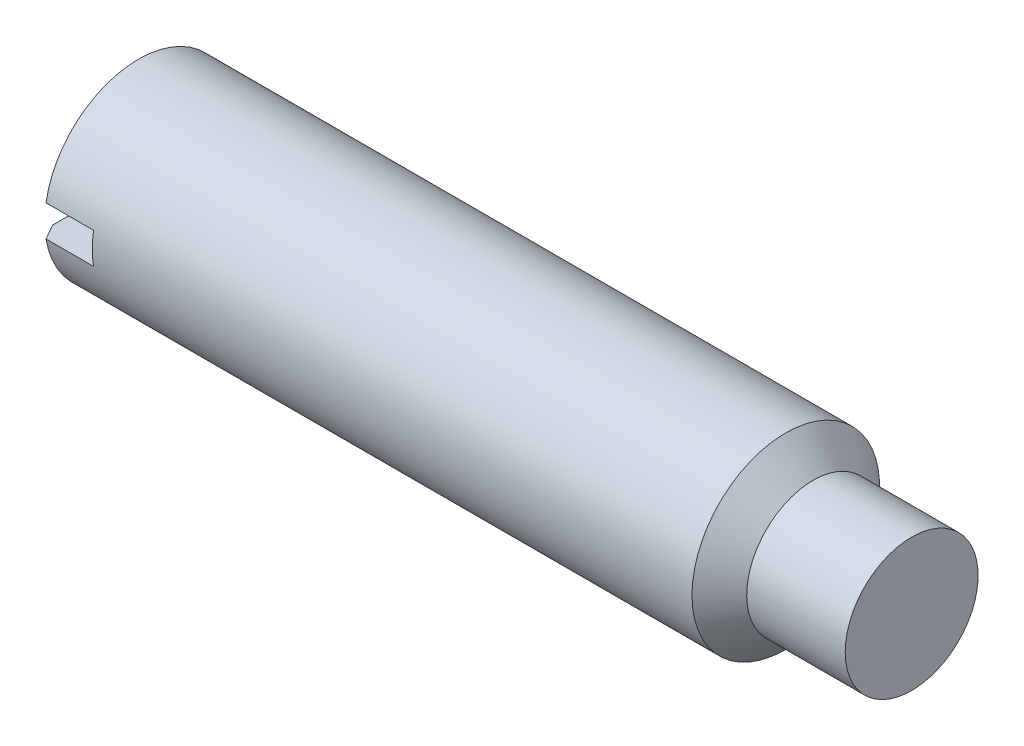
from build123d import *

# Parameters (mm, degrees)
SKETCH2_W  = 12
SKETCH2_H  = 2
SLOT_DEPTH = 3.6


with BuildPart() as part:
    # BodySke → BaseBody (revolve)
    with BuildSketch(Plane.XY, mode=Mode.PRIVATE) as basebody_sk:
        Polygon((43.7, 4.25), (50, 4.25), (50, 0), (0, 0), (0, 5.036), (0.556565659, 6), (41.95, 6), align=None)
    revolve(basebody_sk.sketch.rotate(Axis((-12.7, 0, 0), (1, 0, 0)), 90), axis=Axis((-12.7, 0, 0), (1, 0, 0)))

    # Sketch2 → Slot (cut)
    with BuildSketch(Plane(origin=(0, 0, 0), x_dir=(0, 0, -1), z_dir=(1, 0, 0))):
        Rectangle(SKETCH2_W, SKETCH2_H)
    extrude(amount=SLOT_DEPTH, mode=Mode.SUBTRACT)


solid = part.part
